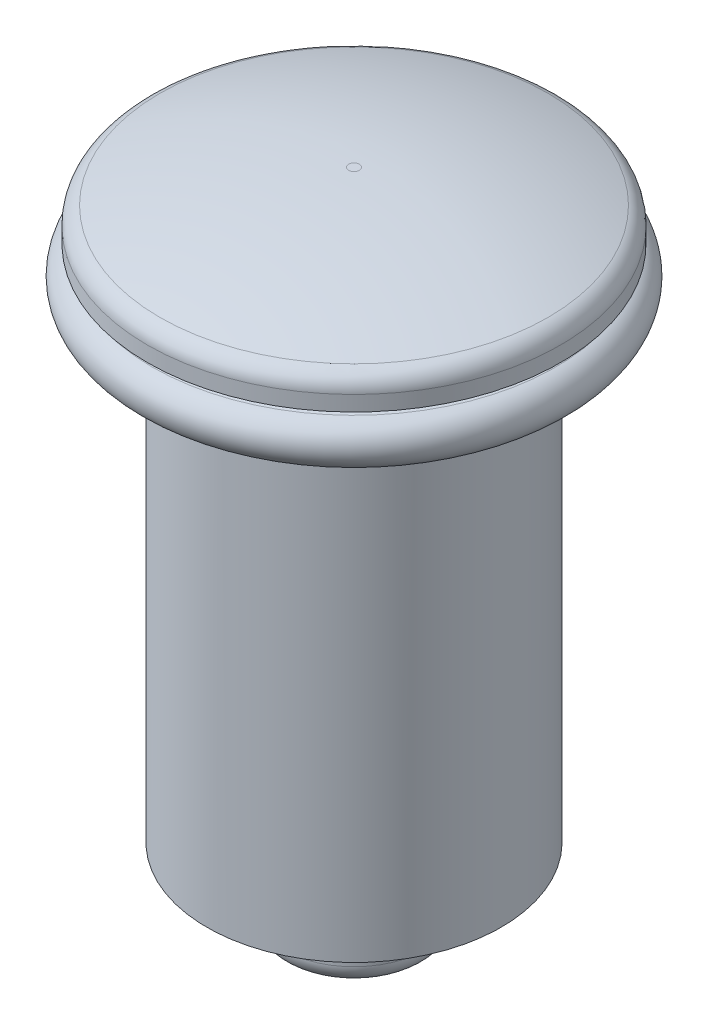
from build123d import *

# Parameters (mm, degrees)
FILLET1_R           = 0.254
SKETCH3_R           = 0.973081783
BOSS_EXTRUDE1_DEPTH = 1.016
FILLET2_R           = 0.254


with BuildPart() as part:
    # Sketch1 → Revolve1 (revolve)
    with BuildSketch(Plane(origin=(0, 0, 0), x_dir=(0, 0, -1), z_dir=(1, 0, 0))):
        with BuildLine():
            Line((1.9812, 0), (1.9812, -6.985))
            Line((1.9812, -6.985), (0, -6.985))
            Line((0, -6.985), (0, 0.889))
            Line((0, 0.889), (0.071932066, 0.889))
            ThreePointArc((0.071932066, 0.889), (1.450222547, 0.760903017), (2.7813, 0.381))
            Line((2.7813, 0.381), (2.7813, 0))
            Line((2.7813, 0), (1.9812, 0))
        make_face()
    revolve(axis=Axis((0, 0, 0), (0, 1, 0)))

    # Fillet1
    fillet1_edges = [part.edges().sort_by_distance(p)[0] for p in [
        (0, 0.381, 2.7813),
    ]]
    fillet(fillet1_edges, radius=FILLET1_R)

    # Sketch2 → Revolve2 (revolve)
    with BuildSketch(Plane(origin=(0, 0, 0), x_dir=(0, 0, -1), z_dir=(1, 0, 0))):
        with BuildLine():
            Line((2.461468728, 0), (2.716928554, -0.083395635))
            ThreePointArc((2.716928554, -0.083395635), (2.925030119, -0.443709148), (2.589198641, -0.689370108))
            Line((2.589198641, -0.689370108), (1.9812, -0.689370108))
            Line((1.9812, -0.689370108), (1.9812, 0))
            Line((1.9812, 0), (2.461468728, 0))
        make_face()
    revolve(axis=Axis((0, -0.083395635, 0), (0, 1, 0)))

    # Sketch3 → Boss-Extrude1 (add)
    with BuildSketch(Plane.XZ.offset(6.985)):
        with Locations(Location((0, 0, 0), (0, 0, 270))):
            Circle(SKETCH3_R)
    extrude(amount=BOSS_EXTRUDE1_DEPTH)

    # Fillet2
    fillet2_edges = [part.edges().sort_by_distance(p)[0] for p in [
        (0, -8.001, 0.973081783),
    ]]
    fillet(fillet2_edges, radius=FILLET2_R)


solid = part.part
